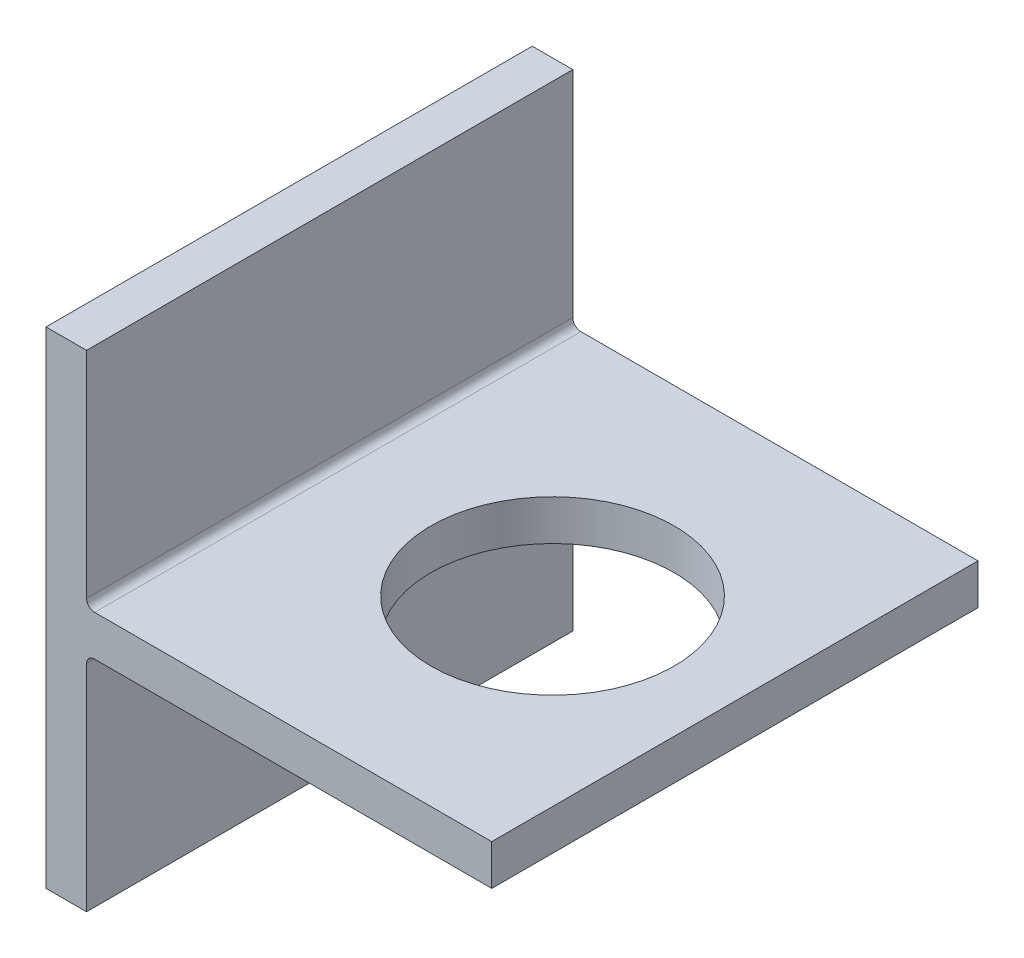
ISO-10303-21;
HEADER;
FILE_DESCRIPTION(('STEP AP214'),'2;1');
FILE_NAME('part.step','',(''),(''),'','','');
FILE_SCHEMA(('AUTOMOTIVE_DESIGN { 1 0 10303 214 1 1 1 1 }'));
ENDSEC;
DATA;
#1=APPLICATION_CONTEXT('core data for automotive mechanical design processes');
#2=APPLICATION_PROTOCOL_DEFINITION('international standard','automotive_design',2000,#1);
#3=PRODUCT_CONTEXT('',#1,'mechanical');
#4=PRODUCT('Part','Part','',(#3));
#5=PRODUCT_RELATED_PRODUCT_CATEGORY('part','',(#4));
#6=PRODUCT_DEFINITION_FORMATION('','',#4);
#7=PRODUCT_DEFINITION_CONTEXT('part definition',#1,'design');
#8=PRODUCT_DEFINITION('design','',#6,#7);
#9=PRODUCT_DEFINITION_SHAPE('','',#8);
#10=(LENGTH_UNIT() NAMED_UNIT(*) SI_UNIT(.MILLI.,.METRE.));
#11=(NAMED_UNIT(*) PLANE_ANGLE_UNIT() SI_UNIT($,.RADIAN.));
#12=(NAMED_UNIT(*) SI_UNIT($,.STERADIAN.) SOLID_ANGLE_UNIT());
#13=UNCERTAINTY_MEASURE_WITH_UNIT(LENGTH_MEASURE(1.E-05),#10,'distance_accuracy_value','');
#14=(GEOMETRIC_REPRESENTATION_CONTEXT(3) GLOBAL_UNCERTAINTY_ASSIGNED_CONTEXT((#13)) GLOBAL_UNIT_ASSIGNED_CONTEXT((#10,
#11,#12)) REPRESENTATION_CONTEXT('',''));
#15=CARTESIAN_POINT('',(0.,0.,0.));
#16=DIRECTION('',(0.,0.,1.));
#17=DIRECTION('',(1.,0.,0.));
#18=AXIS2_PLACEMENT_3D('',#15,#16,#17);
#19=CARTESIAN_POINT('',(0.,-60.,120.));
#20=DIRECTION('',(1.,0.,0.));
#21=DIRECTION('',(0.,0.,-1.));
#22=AXIS2_PLACEMENT_3D('',#19,#20,#21);
#23=PLANE('',#22);
#24=DIRECTION('',(0.,-1.,0.));
#25=VECTOR('',#24,1.);
#26=CARTESIAN_POINT('',(0.,-60.,0.));
#27=LINE('',#26,#25);
#28=CARTESIAN_POINT('',(0.,60.,0.));
#29=VERTEX_POINT('',#28);
#30=CARTESIAN_POINT('',(0.,-60.,0.));
#31=VERTEX_POINT('',#30);
#32=EDGE_CURVE('E136',#29,#31,#27,.T.);
#33=ORIENTED_EDGE('',*,*,#32,.T.);
#34=DIRECTION('',(0.,0.,-1.));
#35=VECTOR('',#34,1.);
#36=CARTESIAN_POINT('',(0.,-60.,120.));
#37=LINE('',#36,#35);
#38=CARTESIAN_POINT('',(0.,-60.,120.));
#39=VERTEX_POINT('',#38);
#40=EDGE_CURVE('E116',#39,#31,#37,.T.);
#41=ORIENTED_EDGE('',*,*,#40,.F.);
#42=DIRECTION('',(0.,-1.,0.));
#43=VECTOR('',#42,1.);
#44=CARTESIAN_POINT('',(0.,-60.,120.));
#45=LINE('',#44,#43);
#46=CARTESIAN_POINT('',(0.,60.,120.));
#47=VERTEX_POINT('',#46);
#48=EDGE_CURVE('E124',#47,#39,#45,.T.);
#49=ORIENTED_EDGE('',*,*,#48,.F.);
#50=DIRECTION('',(0.,0.,-1.));
#51=VECTOR('',#50,1.);
#52=CARTESIAN_POINT('',(0.,60.,120.));
#53=LINE('',#52,#51);
#54=EDGE_CURVE('E191',#47,#29,#53,.T.);
#55=ORIENTED_EDGE('',*,*,#54,.T.);
#56=EDGE_LOOP('',(#33,#41,#49,#55));
#57=FACE_BOUND('',#56,.T.);
#58=ADVANCED_FACE('F34',(#57),#23,.F.);
#59=CARTESIAN_POINT('',(0.,-60.,120.));
#60=DIRECTION('',(0.,1.,0.));
#61=DIRECTION('',(-1.,0.,0.));
#62=AXIS2_PLACEMENT_3D('',#59,#60,#61);
#63=PLANE('',#62);
#64=DIRECTION('',(1.,0.,0.));
#65=VECTOR('',#64,1.);
#66=CARTESIAN_POINT('',(0.,-60.,0.));
#67=LINE('',#66,#65);
#68=CARTESIAN_POINT('',(10.,-60.,0.));
#69=VERTEX_POINT('',#68);
#70=EDGE_CURVE('E178',#31,#69,#67,.T.);
#71=ORIENTED_EDGE('',*,*,#70,.T.);
#72=DIRECTION('',(0.,0.,-1.));
#73=VECTOR('',#72,1.);
#74=CARTESIAN_POINT('',(10.,-60.,120.));
#75=LINE('',#74,#73);
#76=CARTESIAN_POINT('',(10.,-60.,120.));
#77=VERTEX_POINT('',#76);
#78=EDGE_CURVE('E119',#77,#69,#75,.T.);
#79=ORIENTED_EDGE('',*,*,#78,.F.);
#80=DIRECTION('',(1.,0.,0.));
#81=VECTOR('',#80,1.);
#82=CARTESIAN_POINT('',(0.,-60.,120.));
#83=LINE('',#82,#81);
#84=EDGE_CURVE('E112',#39,#77,#83,.T.);
#85=ORIENTED_EDGE('',*,*,#84,.F.);
#86=ORIENTED_EDGE('',*,*,#40,.T.);
#87=EDGE_LOOP('',(#71,#79,#85,#86));
#88=FACE_BOUND('',#87,.T.);
#89=ADVANCED_FACE('F114',(#88),#63,.F.);
#90=CARTESIAN_POINT('',(10.,-60.,120.));
#91=DIRECTION('',(-1.,0.,0.));
#92=DIRECTION('',(0.,-1.,0.));
#93=AXIS2_PLACEMENT_3D('',#90,#91,#92);
#94=PLANE('',#93);
#95=DIRECTION('',(0.,1.,0.));
#96=VECTOR('',#95,1.);
#97=CARTESIAN_POINT('',(10.,-60.,0.));
#98=LINE('',#97,#96);
#99=CARTESIAN_POINT('',(9.99999999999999,-7.,0.));
#100=VERTEX_POINT('',#99);
#101=EDGE_CURVE('E173',#69,#100,#98,.T.);
#102=ORIENTED_EDGE('',*,*,#101,.T.);
#103=DIRECTION('',(0.,0.,-1.));
#104=VECTOR('',#103,1.);
#105=CARTESIAN_POINT('',(9.99999999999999,-7.,120.));
#106=LINE('',#105,#104);
#107=CARTESIAN_POINT('',(9.99999999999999,-7.,120.));
#108=VERTEX_POINT('',#107);
#109=EDGE_CURVE('E140',#100,#108,#106,.F.);
#110=ORIENTED_EDGE('',*,*,#109,.T.);
#111=DIRECTION('',(0.,1.,0.));
#112=VECTOR('',#111,1.);
#113=CARTESIAN_POINT('',(10.,-60.,120.));
#114=LINE('',#113,#112);
#115=EDGE_CURVE('E123',#77,#108,#114,.T.);
#116=ORIENTED_EDGE('',*,*,#115,.F.);
#117=ORIENTED_EDGE('',*,*,#78,.T.);
#118=EDGE_LOOP('',(#102,#110,#116,#117));
#119=FACE_BOUND('',#118,.T.);
#120=ADVANCED_FACE('F177',(#119),#94,.F.);
#121=CARTESIAN_POINT('',(9.99999999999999,-5.,120.));
#122=DIRECTION('',(0.,1.,0.));
#123=DIRECTION('',(-1.,0.,0.));
#124=AXIS2_PLACEMENT_3D('',#121,#122,#123);
#125=PLANE('',#124);
#126=CARTESIAN_POINT('',(65.,-5.,60.));
#127=DIRECTION('',(0.,1.,0.));
#128=DIRECTION('',(-1.,0.,0.));
#129=AXIS2_PLACEMENT_3D('',#126,#127,#128);
#130=CIRCLE('',#129,30.);
#131=CARTESIAN_POINT('',(65.,-5.,90.));
#132=VERTEX_POINT('',#131);
#133=EDGE_CURVE('E215',#132,#132,#130,.T.);
#134=ORIENTED_EDGE('',*,*,#133,.T.);
#135=EDGE_LOOP('',(#134));
#136=FACE_BOUND('',#135,.T.);
#137=DIRECTION('',(1.,0.,0.));
#138=VECTOR('',#137,1.);
#139=CARTESIAN_POINT('',(9.99999999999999,-5.,120.));
#140=LINE('',#139,#138);
#141=CARTESIAN_POINT('',(12.,-5.,120.));
#142=VERTEX_POINT('',#141);
#143=CARTESIAN_POINT('',(110.,-5.,120.));
#144=VERTEX_POINT('',#143);
#145=EDGE_CURVE('E157',#142,#144,#140,.T.);
#146=ORIENTED_EDGE('',*,*,#145,.F.);
#147=DIRECTION('',(0.,0.,-1.));
#148=VECTOR('',#147,1.);
#149=CARTESIAN_POINT('',(12.,-5.,0.));
#150=LINE('',#149,#148);
#151=CARTESIAN_POINT('',(12.,-5.,0.));
#152=VERTEX_POINT('',#151);
#153=EDGE_CURVE('E137',#142,#152,#150,.T.);
#154=ORIENTED_EDGE('',*,*,#153,.T.);
#155=DIRECTION('',(1.,0.,0.));
#156=VECTOR('',#155,1.);
#157=CARTESIAN_POINT('',(9.99999999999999,-5.,0.));
#158=LINE('',#157,#156);
#159=CARTESIAN_POINT('',(110.,-5.,0.));
#160=VERTEX_POINT('',#159);
#161=EDGE_CURVE('E175',#152,#160,#158,.T.);
#162=ORIENTED_EDGE('',*,*,#161,.T.);
#163=DIRECTION('',(0.,0.,-1.));
#164=VECTOR('',#163,1.);
#165=CARTESIAN_POINT('',(110.,-5.,120.));
#166=LINE('',#165,#164);
#167=EDGE_CURVE('E142',#144,#160,#166,.T.);
#168=ORIENTED_EDGE('',*,*,#167,.F.);
#169=EDGE_LOOP('',(#146,#154,#162,#168));
#170=FACE_BOUND('',#169,.T.);
#171=ADVANCED_FACE('F163',(#136,#170),#125,.F.);
#172=CARTESIAN_POINT('',(110.,5.,120.));
#173=DIRECTION('',(-1.,0.,0.));
#174=DIRECTION('',(0.,0.,1.));
#175=AXIS2_PLACEMENT_3D('',#172,#173,#174);
#176=PLANE('',#175);
#177=DIRECTION('',(0.,1.,0.));
#178=VECTOR('',#177,1.);
#179=CARTESIAN_POINT('',(110.,5.,0.));
#180=LINE('',#179,#178);
#181=CARTESIAN_POINT('',(110.,5.,0.));
#182=VERTEX_POINT('',#181);
#183=EDGE_CURVE('E180',#160,#182,#180,.T.);
#184=ORIENTED_EDGE('',*,*,#183,.T.);
#185=DIRECTION('',(0.,0.,-1.));
#186=VECTOR('',#185,1.);
#187=CARTESIAN_POINT('',(110.,5.,120.));
#188=LINE('',#187,#186);
#189=CARTESIAN_POINT('',(110.,5.,120.));
#190=VERTEX_POINT('',#189);
#191=EDGE_CURVE('E196',#190,#182,#188,.T.);
#192=ORIENTED_EDGE('',*,*,#191,.F.);
#193=DIRECTION('',(0.,1.,0.));
#194=VECTOR('',#193,1.);
#195=CARTESIAN_POINT('',(110.,5.,120.));
#196=LINE('',#195,#194);
#197=EDGE_CURVE('E167',#144,#190,#196,.T.);
#198=ORIENTED_EDGE('',*,*,#197,.F.);
#199=ORIENTED_EDGE('',*,*,#167,.T.);
#200=EDGE_LOOP('',(#184,#192,#198,#199));
#201=FACE_BOUND('',#200,.T.);
#202=ADVANCED_FACE('F199',(#201),#176,.F.);
#203=CARTESIAN_POINT('',(9.99999999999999,5.,120.));
#204=DIRECTION('',(0.,-1.,0.));
#205=DIRECTION('',(1.,0.,0.));
#206=AXIS2_PLACEMENT_3D('',#203,#204,#205);
#207=PLANE('',#206);
#208=CARTESIAN_POINT('',(65.,5.,60.));
#209=DIRECTION('',(0.,-1.,0.));
#210=DIRECTION('',(1.,0.,0.));
#211=AXIS2_PLACEMENT_3D('',#208,#209,#210);
#212=CIRCLE('',#211,30.);
#213=CARTESIAN_POINT('',(65.,5.00000000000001,90.));
#214=VERTEX_POINT('',#213);
#215=EDGE_CURVE('E38',#214,#214,#212,.T.);
#216=ORIENTED_EDGE('',*,*,#215,.T.);
#217=EDGE_LOOP('',(#216));
#218=FACE_BOUND('',#217,.T.);
#219=DIRECTION('',(-1.,0.,0.));
#220=VECTOR('',#219,1.);
#221=CARTESIAN_POINT('',(9.99999999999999,5.,0.));
#222=LINE('',#221,#220);
#223=CARTESIAN_POINT('',(12.,5.,0.));
#224=VERTEX_POINT('',#223);
#225=EDGE_CURVE('E186',#182,#224,#222,.T.);
#226=ORIENTED_EDGE('',*,*,#225,.T.);
#227=DIRECTION('',(0.,0.,-1.));
#228=VECTOR('',#227,1.);
#229=CARTESIAN_POINT('',(12.,5.,120.));
#230=LINE('',#229,#228);
#231=CARTESIAN_POINT('',(12.,5.,120.));
#232=VERTEX_POINT('',#231);
#233=EDGE_CURVE('E50',#224,#232,#230,.F.);
#234=ORIENTED_EDGE('',*,*,#233,.T.);
#235=DIRECTION('',(-1.,0.,0.));
#236=VECTOR('',#235,1.);
#237=CARTESIAN_POINT('',(9.99999999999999,5.,120.));
#238=LINE('',#237,#236);
#239=EDGE_CURVE('E208',#190,#232,#238,.T.);
#240=ORIENTED_EDGE('',*,*,#239,.F.);
#241=ORIENTED_EDGE('',*,*,#191,.T.);
#242=EDGE_LOOP('',(#226,#234,#240,#241));
#243=FACE_BOUND('',#242,.T.);
#244=ADVANCED_FACE('F201',(#218,#243),#207,.F.);
#245=CARTESIAN_POINT('',(9.99999999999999,5.,120.));
#246=DIRECTION('',(-1.,0.,0.));
#247=DIRECTION('',(0.,-1.,0.));
#248=AXIS2_PLACEMENT_3D('',#245,#246,#247);
#249=PLANE('',#248);
#250=DIRECTION('',(0.,1.,0.));
#251=VECTOR('',#250,1.);
#252=CARTESIAN_POINT('',(9.99999999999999,5.,120.));
#253=LINE('',#252,#251);
#254=CARTESIAN_POINT('',(9.99999999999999,7.,120.));
#255=VERTEX_POINT('',#254);
#256=CARTESIAN_POINT('',(9.99999999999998,60.,120.));
#257=VERTEX_POINT('',#256);
#258=EDGE_CURVE('E206',#255,#257,#253,.T.);
#259=ORIENTED_EDGE('',*,*,#258,.F.);
#260=DIRECTION('',(0.,0.,-1.));
#261=VECTOR('',#260,1.);
#262=CARTESIAN_POINT('',(9.99999999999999,7.,0.));
#263=LINE('',#262,#261);
#264=CARTESIAN_POINT('',(9.99999999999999,7.,0.));
#265=VERTEX_POINT('',#264);
#266=EDGE_CURVE('E147',#255,#265,#263,.T.);
#267=ORIENTED_EDGE('',*,*,#266,.T.);
#268=DIRECTION('',(0.,1.,0.));
#269=VECTOR('',#268,1.);
#270=CARTESIAN_POINT('',(9.99999999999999,5.,0.));
#271=LINE('',#270,#269);
#272=CARTESIAN_POINT('',(9.99999999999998,60.,0.));
#273=VERTEX_POINT('',#272);
#274=EDGE_CURVE('E188',#265,#273,#271,.T.);
#275=ORIENTED_EDGE('',*,*,#274,.T.);
#276=DIRECTION('',(0.,0.,-1.));
#277=VECTOR('',#276,1.);
#278=CARTESIAN_POINT('',(9.99999999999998,60.,120.));
#279=LINE('',#278,#277);
#280=EDGE_CURVE('E193',#257,#273,#279,.T.);
#281=ORIENTED_EDGE('',*,*,#280,.F.);
#282=EDGE_LOOP('',(#259,#267,#275,#281));
#283=FACE_BOUND('',#282,.T.);
#284=ADVANCED_FACE('F210',(#283),#249,.F.);
#285=CARTESIAN_POINT('',(0.,60.,120.));
#286=DIRECTION('',(0.,-1.,0.));
#287=DIRECTION('',(0.,0.,-1.));
#288=AXIS2_PLACEMENT_3D('',#285,#286,#287);
#289=PLANE('',#288);
#290=DIRECTION('',(-1.,0.,0.));
#291=VECTOR('',#290,1.);
#292=CARTESIAN_POINT('',(0.,60.,0.));
#293=LINE('',#292,#291);
#294=EDGE_CURVE('E133',#273,#29,#293,.T.);
#295=ORIENTED_EDGE('',*,*,#294,.T.);
#296=ORIENTED_EDGE('',*,*,#54,.F.);
#297=DIRECTION('',(-1.,0.,0.));
#298=VECTOR('',#297,1.);
#299=CARTESIAN_POINT('',(0.,60.,120.));
#300=LINE('',#299,#298);
#301=EDGE_CURVE('E129',#257,#47,#300,.T.);
#302=ORIENTED_EDGE('',*,*,#301,.F.);
#303=ORIENTED_EDGE('',*,*,#280,.T.);
#304=EDGE_LOOP('',(#295,#296,#302,#303));
#305=FACE_BOUND('',#304,.T.);
#306=ADVANCED_FACE('F248',(#305),#289,.F.);
#307=CARTESIAN_POINT('',(0.,60.,120.));
#308=DIRECTION('',(0.,0.,-1.));
#309=DIRECTION('',(-1.,0.,0.));
#310=AXIS2_PLACEMENT_3D('',#307,#308,#309);
#311=PLANE('',#310);
#312=ORIENTED_EDGE('',*,*,#48,.T.);
#313=ORIENTED_EDGE('',*,*,#84,.T.);
#314=ORIENTED_EDGE('',*,*,#115,.T.);
#315=CARTESIAN_POINT('',(12.,-7.,120.));
#316=DIRECTION('',(0.,0.,-1.));
#317=DIRECTION('',(-1.,0.,0.));
#318=AXIS2_PLACEMENT_3D('',#315,#316,#317);
#319=CIRCLE('',#318,2.);
#320=EDGE_CURVE('E153',#108,#142,#319,.T.);
#321=ORIENTED_EDGE('',*,*,#320,.T.);
#322=ORIENTED_EDGE('',*,*,#145,.T.);
#323=ORIENTED_EDGE('',*,*,#197,.T.);
#324=ORIENTED_EDGE('',*,*,#239,.T.);
#325=CARTESIAN_POINT('',(12.,7.,120.));
#326=DIRECTION('',(0.,0.,-1.));
#327=DIRECTION('',(-1.,0.,0.));
#328=AXIS2_PLACEMENT_3D('',#325,#326,#327);
#329=CIRCLE('',#328,2.);
#330=EDGE_CURVE('E11',#232,#255,#329,.T.);
#331=ORIENTED_EDGE('',*,*,#330,.T.);
#332=ORIENTED_EDGE('',*,*,#258,.T.);
#333=ORIENTED_EDGE('',*,*,#301,.T.);
#334=EDGE_LOOP('',(#312,#313,#314,#321,#322,#323,#324,#331,#332,#333));
#335=FACE_BOUND('',#334,.T.);
#336=ADVANCED_FACE('F127',(#335),#311,.F.);
#337=CARTESIAN_POINT('',(0.,60.,0.));
#338=DIRECTION('',(0.,0.,-1.));
#339=DIRECTION('',(-1.,0.,0.));
#340=AXIS2_PLACEMENT_3D('',#337,#338,#339);
#341=PLANE('',#340);
#342=ORIENTED_EDGE('',*,*,#32,.F.);
#343=ORIENTED_EDGE('',*,*,#294,.F.);
#344=ORIENTED_EDGE('',*,*,#274,.F.);
#345=CARTESIAN_POINT('',(12.,7.,0.));
#346=DIRECTION('',(0.,0.,-1.));
#347=DIRECTION('',(-1.,0.,0.));
#348=AXIS2_PLACEMENT_3D('',#345,#346,#347);
#349=CIRCLE('',#348,2.);
#350=EDGE_CURVE('E43',#265,#224,#349,.F.);
#351=ORIENTED_EDGE('',*,*,#350,.T.);
#352=ORIENTED_EDGE('',*,*,#225,.F.);
#353=ORIENTED_EDGE('',*,*,#183,.F.);
#354=ORIENTED_EDGE('',*,*,#161,.F.);
#355=CARTESIAN_POINT('',(12.,-7.,0.));
#356=DIRECTION('',(0.,0.,-1.));
#357=DIRECTION('',(-1.,0.,0.));
#358=AXIS2_PLACEMENT_3D('',#355,#356,#357);
#359=CIRCLE('',#358,2.);
#360=EDGE_CURVE('E151',#152,#100,#359,.F.);
#361=ORIENTED_EDGE('',*,*,#360,.T.);
#362=ORIENTED_EDGE('',*,*,#101,.F.);
#363=ORIENTED_EDGE('',*,*,#70,.F.);
#364=EDGE_LOOP('',(#342,#343,#344,#351,#352,#353,#354,#361,#362,#363));
#365=FACE_BOUND('',#364,.T.);
#366=ADVANCED_FACE('F172',(#365),#341,.T.);
#367=CARTESIAN_POINT('',(12.,-7.,120.));
#368=DIRECTION('',(0.,0.,1.));
#369=DIRECTION('',(1.,0.,0.));
#370=AXIS2_PLACEMENT_3D('',#367,#368,#369);
#371=CYLINDRICAL_SURFACE('',#370,2.);
#372=ORIENTED_EDGE('',*,*,#320,.F.);
#373=ORIENTED_EDGE('',*,*,#109,.F.);
#374=ORIENTED_EDGE('',*,*,#360,.F.);
#375=ORIENTED_EDGE('',*,*,#153,.F.);
#376=EDGE_LOOP('',(#372,#373,#374,#375));
#377=FACE_BOUND('',#376,.T.);
#378=ADVANCED_FACE('F169',(#377),#371,.F.);
#379=CARTESIAN_POINT('',(12.,7.,120.));
#380=DIRECTION('',(0.,0.,1.));
#381=DIRECTION('',(1.,0.,0.));
#382=AXIS2_PLACEMENT_3D('',#379,#380,#381);
#383=CYLINDRICAL_SURFACE('',#382,2.);
#384=ORIENTED_EDGE('',*,*,#330,.F.);
#385=ORIENTED_EDGE('',*,*,#233,.F.);
#386=ORIENTED_EDGE('',*,*,#350,.F.);
#387=ORIENTED_EDGE('',*,*,#266,.F.);
#388=EDGE_LOOP('',(#384,#385,#386,#387));
#389=FACE_BOUND('',#388,.T.);
#390=ADVANCED_FACE('F36',(#389),#383,.F.);
#391=CARTESIAN_POINT('',(65.,-60.,60.));
#392=DIRECTION('',(0.,1.,0.));
#393=DIRECTION('',(0.,0.,1.));
#394=AXIS2_PLACEMENT_3D('',#391,#392,#393);
#395=CYLINDRICAL_SURFACE('',#394,30.);
#396=CARTESIAN_POINT('',(65.,5.00000000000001,90.));
#397=CARTESIAN_POINT('',(65.,4.89583333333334,90.));
#398=CARTESIAN_POINT('',(65.,4.79166666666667,90.));
#399=CARTESIAN_POINT('',(65.,4.58333333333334,90.));
#400=CARTESIAN_POINT('',(65.,4.47916666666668,90.));
#401=CARTESIAN_POINT('',(65.,4.27083333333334,90.));
#402=CARTESIAN_POINT('',(65.,4.16666666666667,90.));
#403=CARTESIAN_POINT('',(65.,3.95833333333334,90.));
#404=CARTESIAN_POINT('',(65.,3.85416666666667,90.));
#405=CARTESIAN_POINT('',(65.,3.64583333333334,90.));
#406=CARTESIAN_POINT('',(65.,3.54166666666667,90.));
#407=CARTESIAN_POINT('',(65.,3.33333333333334,90.));
#408=CARTESIAN_POINT('',(65.,3.22916666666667,90.));
#409=CARTESIAN_POINT('',(65.,3.02083333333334,90.));
#410=CARTESIAN_POINT('',(65.,2.91666666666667,90.));
#411=CARTESIAN_POINT('',(65.,2.70833333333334,90.));
#412=CARTESIAN_POINT('',(65.,2.60416666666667,90.));
#413=CARTESIAN_POINT('',(65.,2.39583333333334,90.));
#414=CARTESIAN_POINT('',(65.,2.29166666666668,90.));
#415=CARTESIAN_POINT('',(65.,2.08333333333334,90.));
#416=CARTESIAN_POINT('',(65.,1.97916666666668,90.));
#417=CARTESIAN_POINT('',(65.,1.77083333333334,90.));
#418=CARTESIAN_POINT('',(65.,1.66666666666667,90.));
#419=CARTESIAN_POINT('',(65.,1.45833333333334,90.));
#420=CARTESIAN_POINT('',(65.,1.35416666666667,90.));
#421=CARTESIAN_POINT('',(65.,1.14583333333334,90.));
#422=CARTESIAN_POINT('',(65.,1.04166666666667,90.));
#423=CARTESIAN_POINT('',(65.,0.833333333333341,90.));
#424=CARTESIAN_POINT('',(65.,0.729166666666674,90.));
#425=CARTESIAN_POINT('',(65.,0.520833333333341,90.));
#426=CARTESIAN_POINT('',(65.,0.416666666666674,90.));
#427=CARTESIAN_POINT('',(65.,0.20833333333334,90.));
#428=CARTESIAN_POINT('',(65.,0.104166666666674,90.));
#429=CARTESIAN_POINT('',(65.,-0.10416666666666,90.));
#430=CARTESIAN_POINT('',(65.,-0.208333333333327,90.));
#431=CARTESIAN_POINT('',(65.,-0.41666666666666,90.));
#432=CARTESIAN_POINT('',(65.,-0.520833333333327,90.));
#433=CARTESIAN_POINT('',(65.,-0.72916666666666,90.));
#434=CARTESIAN_POINT('',(65.,-0.833333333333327,90.));
#435=CARTESIAN_POINT('',(65.,-1.04166666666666,90.));
#436=CARTESIAN_POINT('',(65.,-1.14583333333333,90.));
#437=CARTESIAN_POINT('',(65.,-1.35416666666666,90.));
#438=CARTESIAN_POINT('',(65.,-1.45833333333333,90.));
#439=CARTESIAN_POINT('',(65.,-1.66666666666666,90.));
#440=CARTESIAN_POINT('',(65.,-1.77083333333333,90.));
#441=CARTESIAN_POINT('',(65.,-1.97916666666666,90.));
#442=CARTESIAN_POINT('',(65.,-2.08333333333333,90.));
#443=CARTESIAN_POINT('',(65.,-2.29166666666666,90.));
#444=CARTESIAN_POINT('',(65.,-2.39583333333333,90.));
#445=CARTESIAN_POINT('',(65.,-2.60416666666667,90.));
#446=CARTESIAN_POINT('',(65.,-2.70833333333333,90.));
#447=CARTESIAN_POINT('',(65.,-2.91666666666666,90.));
#448=CARTESIAN_POINT('',(65.,-3.02083333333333,90.));
#449=CARTESIAN_POINT('',(65.,-3.22916666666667,90.));
#450=CARTESIAN_POINT('',(65.,-3.33333333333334,90.));
#451=CARTESIAN_POINT('',(65.,-3.54166666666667,90.));
#452=CARTESIAN_POINT('',(65.,-3.64583333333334,90.));
#453=CARTESIAN_POINT('',(65.,-3.85416666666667,90.));
#454=CARTESIAN_POINT('',(65.,-3.95833333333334,90.));
#455=CARTESIAN_POINT('',(65.,-4.16666666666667,90.));
#456=CARTESIAN_POINT('',(65.,-4.27083333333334,90.));
#457=CARTESIAN_POINT('',(65.,-4.47916666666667,90.));
#458=CARTESIAN_POINT('',(65.,-4.58333333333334,90.));
#459=CARTESIAN_POINT('',(65.,-4.79166666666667,90.));
#460=CARTESIAN_POINT('',(65.,-4.89583333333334,90.));
#461=CARTESIAN_POINT('',(65.,-5.,90.));
#462=B_SPLINE_CURVE_WITH_KNOTS('',3,(#396,#397,#398,#399,#400,#401,#402,#403,#404,#405,#406,
#407,#408,#409,#410,#411,#412,#413,#414,#415,#416,#417,#418,#419,#420,#421,#422,#423,#424,#425,
#426,#427,#428,#429,#430,#431,#432,#433,#434,#435,#436,#437,#438,#439,#440,#441,#442,#443,#444,
#445,#446,#447,#448,#449,#450,#451,#452,#453,#454,#455,#456,#457,#458,#459,#460,#461),
.UNSPECIFIED.,.F.,.F.,(4,2,2,2,2,2,2,2,2,2,2,2,2,2,2,2,2,2,2,2,2,2,2,2,2,2,2,2,2,2,2,2,4),(0.,
0.312500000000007,0.625000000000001,0.937500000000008,1.25,1.56250000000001,1.875,
2.18750000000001,2.5,2.8125,3.125,3.4375,3.75,4.0625,4.375,4.6875,5.,5.3125,5.62500000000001,
5.93750000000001,6.25000000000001,6.56250000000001,6.87500000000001,7.18750000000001,
7.50000000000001,7.81250000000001,8.12500000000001,8.43750000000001,8.75000000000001,
9.06250000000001,9.37500000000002,9.68750000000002,10.),.UNSPECIFIED.);
#463=EDGE_CURVE('BSEAM225',#214,#132,#462,.T.);
#464=ORIENTED_EDGE('',*,*,#215,.F.);
#465=ORIENTED_EDGE('',*,*,#133,.F.);
#466=ORIENTED_EDGE('',*,*,#463,.T.);
#467=ORIENTED_EDGE('',*,*,#463,.F.);
#468=EDGE_LOOP('',(#464,#466,#465,#467));
#469=FACE_BOUND('',#468,.T.);
#470=ADVANCED_FACE('F225',(#469),#395,.F.);
#471=CLOSED_SHELL('',(#58,#89,#120,#171,#202,#244,#284,#306,#336,#366,#378,#390,#470));
#472=MANIFOLD_SOLID_BREP('B2',#471);
#473=ADVANCED_BREP_SHAPE_REPRESENTATION('',(#18,#472),#14);
#474=SHAPE_DEFINITION_REPRESENTATION(#9,#473);
ENDSEC;
END-ISO-10303-21;
